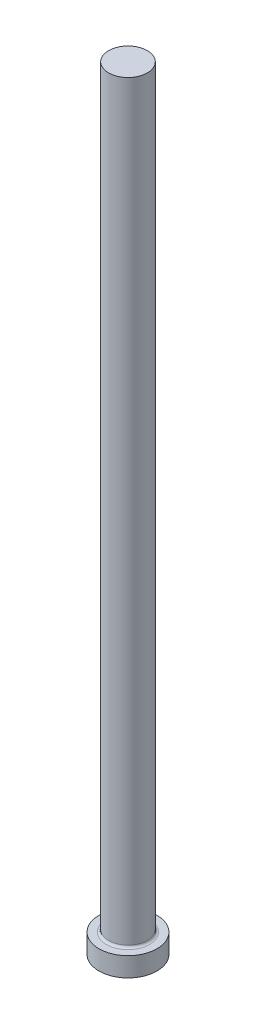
ISO-10303-21;
HEADER;
FILE_DESCRIPTION(('STEP AP214'),'2;1');
FILE_NAME('part.step','',(''),(''),'','','');
FILE_SCHEMA(('AUTOMOTIVE_DESIGN { 1 0 10303 214 1 1 1 1 }'));
ENDSEC;
DATA;
#1=APPLICATION_CONTEXT('core data for automotive mechanical design processes');
#2=APPLICATION_PROTOCOL_DEFINITION('international standard','automotive_design',2000,#1);
#3=PRODUCT_CONTEXT('',#1,'mechanical');
#4=PRODUCT('Part','Part','',(#3));
#5=PRODUCT_RELATED_PRODUCT_CATEGORY('part','',(#4));
#6=PRODUCT_DEFINITION_FORMATION('','',#4);
#7=PRODUCT_DEFINITION_CONTEXT('part definition',#1,'design');
#8=PRODUCT_DEFINITION('design','',#6,#7);
#9=PRODUCT_DEFINITION_SHAPE('','',#8);
#10=(LENGTH_UNIT() NAMED_UNIT(*) SI_UNIT(.MILLI.,.METRE.));
#11=(NAMED_UNIT(*) PLANE_ANGLE_UNIT() SI_UNIT($,.RADIAN.));
#12=(NAMED_UNIT(*) SI_UNIT($,.STERADIAN.) SOLID_ANGLE_UNIT());
#13=UNCERTAINTY_MEASURE_WITH_UNIT(LENGTH_MEASURE(1.E-05),#10,'distance_accuracy_value','');
#14=(GEOMETRIC_REPRESENTATION_CONTEXT(3) GLOBAL_UNCERTAINTY_ASSIGNED_CONTEXT((#13)) GLOBAL_UNIT_ASSIGNED_CONTEXT((#10,
#11,#12)) REPRESENTATION_CONTEXT('',''));
#15=CARTESIAN_POINT('',(0.,0.,0.));
#16=DIRECTION('',(0.,0.,1.));
#17=DIRECTION('',(1.,0.,0.));
#18=AXIS2_PLACEMENT_3D('',#15,#16,#17);
#19=CARTESIAN_POINT('',(6.35000000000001,254.,0.));
#20=DIRECTION('',(0.,-1.,0.));
#21=DIRECTION('',(1.,0.,0.));
#22=AXIS2_PLACEMENT_3D('',#19,#20,#21);
#23=PLANE('',#22);
#24=CARTESIAN_POINT('',(0.,254.,0.));
#25=DIRECTION('',(0.,1.,0.));
#26=DIRECTION('',(-1.,0.,0.));
#27=AXIS2_PLACEMENT_3D('',#24,#25,#26);
#28=CIRCLE('',#27,6.35);
#29=CARTESIAN_POINT('',(-6.34999999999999,254.,0.));
#30=VERTEX_POINT('',#29);
#31=EDGE_CURVE('E10',#30,#30,#28,.T.);
#32=ORIENTED_EDGE('',*,*,#31,.T.);
#33=EDGE_LOOP('',(#32));
#34=FACE_BOUND('',#33,.T.);
#35=ADVANCED_FACE('F30',(#34),#23,.F.);
#36=CARTESIAN_POINT('',(0.,254.,0.));
#37=DIRECTION('',(0.,1.,0.));
#38=DIRECTION('',(-1.,0.,0.));
#39=AXIS2_PLACEMENT_3D('',#36,#37,#38);
#40=CYLINDRICAL_SURFACE('',#39,6.35);
#41=ORIENTED_EDGE('',*,*,#31,.F.);
#42=EDGE_LOOP('',(#41));
#43=FACE_BOUND('',#42,.T.);
#44=CARTESIAN_POINT('',(0.,7.11200000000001,0.));
#45=DIRECTION('',(0.,1.,0.));
#46=DIRECTION('',(-1.,0.,0.));
#47=AXIS2_PLACEMENT_3D('',#44,#45,#46);
#48=CIRCLE('',#47,6.35);
#49=CARTESIAN_POINT('',(-6.35,7.11200000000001,0.));
#50=VERTEX_POINT('',#49);
#51=EDGE_CURVE('E36',#50,#50,#48,.T.);
#52=ORIENTED_EDGE('',*,*,#51,.T.);
#53=EDGE_LOOP('',(#52));
#54=FACE_BOUND('',#53,.T.);
#55=ADVANCED_FACE('F65',(#43,#54),#40,.T.);
#56=CARTESIAN_POINT('',(0.,7.112,0.));
#57=DIRECTION('',(0.,1.,0.));
#58=DIRECTION('',(-1.,0.,0.));
#59=AXIS2_PLACEMENT_3D('',#56,#57,#58);
#60=TOROIDAL_SURFACE('',#59,7.112,0.762);
#61=ORIENTED_EDGE('',*,*,#51,.F.);
#62=EDGE_LOOP('',(#61));
#63=FACE_BOUND('',#62,.T.);
#64=CARTESIAN_POINT('',(0.,6.34999999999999,0.));
#65=DIRECTION('',(0.,1.,0.));
#66=DIRECTION('',(-1.,0.,0.));
#67=AXIS2_PLACEMENT_3D('',#64,#65,#66);
#68=CIRCLE('',#67,7.112);
#69=CARTESIAN_POINT('',(-7.112,6.34999999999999,0.));
#70=VERTEX_POINT('',#69);
#71=EDGE_CURVE('E40',#70,#70,#68,.T.);
#72=ORIENTED_EDGE('',*,*,#71,.T.);
#73=EDGE_LOOP('',(#72));
#74=FACE_BOUND('',#73,.T.);
#75=ADVANCED_FACE('F69',(#63,#74),#60,.F.);
#76=CARTESIAN_POINT('',(9.525,6.35,0.));
#77=DIRECTION('',(0.,-1.,0.));
#78=DIRECTION('',(1.,0.,0.));
#79=AXIS2_PLACEMENT_3D('',#76,#77,#78);
#80=PLANE('',#79);
#81=ORIENTED_EDGE('',*,*,#71,.F.);
#82=EDGE_LOOP('',(#81));
#83=FACE_BOUND('',#82,.T.);
#84=CARTESIAN_POINT('',(0.,6.34999999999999,0.));
#85=DIRECTION('',(0.,1.,0.));
#86=DIRECTION('',(-1.,0.,0.));
#87=AXIS2_PLACEMENT_3D('',#84,#85,#86);
#88=CIRCLE('',#87,9.525);
#89=CARTESIAN_POINT('',(-9.525,6.35,0.));
#90=VERTEX_POINT('',#89);
#91=EDGE_CURVE('E44',#90,#90,#88,.T.);
#92=ORIENTED_EDGE('',*,*,#91,.T.);
#93=EDGE_LOOP('',(#92));
#94=FACE_BOUND('',#93,.T.);
#95=ADVANCED_FACE('F61',(#83,#94),#80,.F.);
#96=CARTESIAN_POINT('',(0.,254.,0.));
#97=DIRECTION('',(0.,1.,0.));
#98=DIRECTION('',(-1.,0.,0.));
#99=AXIS2_PLACEMENT_3D('',#96,#97,#98);
#100=CYLINDRICAL_SURFACE('',#99,9.525);
#101=ORIENTED_EDGE('',*,*,#91,.F.);
#102=EDGE_LOOP('',(#101));
#103=FACE_BOUND('',#102,.T.);
#104=CARTESIAN_POINT('',(0.,0.,0.));
#105=DIRECTION('',(0.,1.,0.));
#106=DIRECTION('',(-1.,0.,0.));
#107=AXIS2_PLACEMENT_3D('',#104,#105,#106);
#108=CIRCLE('',#107,9.525);
#109=CARTESIAN_POINT('',(-9.525,0.,0.));
#110=VERTEX_POINT('',#109);
#111=EDGE_CURVE('E49',#110,#110,#108,.T.);
#112=ORIENTED_EDGE('',*,*,#111,.T.);
#113=EDGE_LOOP('',(#112));
#114=FACE_BOUND('',#113,.T.);
#115=ADVANCED_FACE('F53',(#103,#114),#100,.T.);
#116=CARTESIAN_POINT('',(0.,0.,0.));
#117=DIRECTION('',(0.,1.,0.));
#118=DIRECTION('',(-1.,0.,0.));
#119=AXIS2_PLACEMENT_3D('',#116,#117,#118);
#120=PLANE('',#119);
#121=ORIENTED_EDGE('',*,*,#111,.F.);
#122=EDGE_LOOP('',(#121));
#123=FACE_BOUND('',#122,.T.);
#124=ADVANCED_FACE('F55',(#123),#120,.F.);
#125=CLOSED_SHELL('',(#35,#55,#75,#95,#115,#124));
#126=MANIFOLD_SOLID_BREP('B2',#125);
#127=ADVANCED_BREP_SHAPE_REPRESENTATION('',(#18,#126),#14);
#128=SHAPE_DEFINITION_REPRESENTATION(#9,#127);
ENDSEC;
END-ISO-10303-21;
